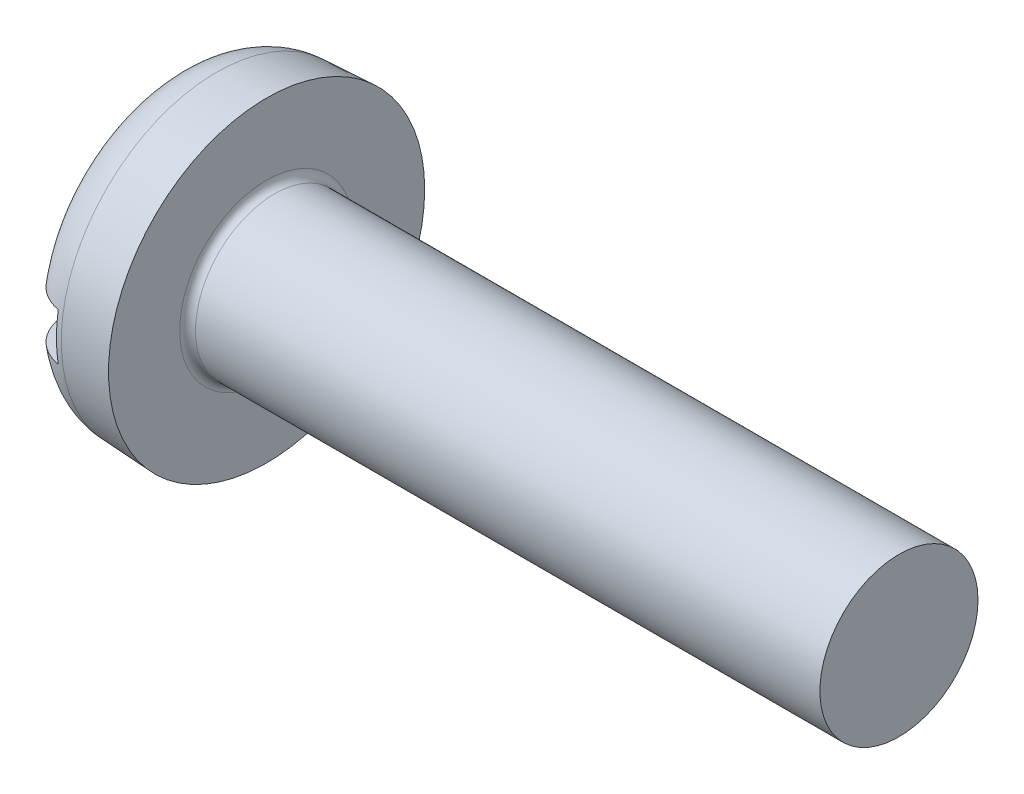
from build123d import *

# Parameters (mm, degrees)
SKETCH1_R        = 4
BASEHEAD_DEPTH   = 2.4
BASEHEAD_DRAFT   = -3
SKETCH2_R        = 2
BASEBODY_DEPTH   = 16
HEADFILLET2_R    = 1.2
NOTCH_DEPTH      = 19.50743094
NOTCH_DEPTH_BACK = 19.50743094
SKETCH3_W        = 1.2
SKETCH3_H        = 1
HEADFILLET1_R    = 0.2


with BuildPart() as part:
    # Sketch1 → BaseHead (with draft: the straight prism first)
    with BuildSketch(Plane(origin=(2.4, 0, 0), x_dir=(0, 0, -1), z_dir=(1, 0, 0))):
        Circle(SKETCH1_R)
    extrude(amount=-BASEHEAD_DEPTH)
    # BaseHead: the draft: its side faces are tilted about the plane it starts from
    basehead_sides = [part.faces().sort_by_distance(p)[0] for p in [
        (1.2, 0, 4),
    ]]
    draft(basehead_sides, Plane(origin=(2.4, 0, 0), x_dir=(0, 0, -1), z_dir=(1, 0, 0)), BASEHEAD_DRAFT)

    # Sketch2 → BaseBody (add)
    with BuildSketch(Plane(origin=(2.4, 0, 0), x_dir=(0, 0, -1), z_dir=(1, 0, 0))):
        Circle(SKETCH2_R)
    extrude(amount=BASEBODY_DEPTH)

    # HeadFillet2
    headfillet2_edges = [part.edges().sort_by_distance(p)[0] for p in [
        (0, 0, 3.87422133),
    ]]
    fillet(headfillet2_edges, radius=HEADFILLET2_R)

    # Sketch3 → Notch (cut, two sides: drawn at the far end of the back side and taken through both)
    with BuildSketch(Plane(origin=(1.05, -1.05, 0), x_dir=(0, -1, 0), z_dir=(0, 0, 1)).offset(-NOTCH_DEPTH_BACK)):
        with Locations((-1.05, -0.55)):
            Rectangle(SKETCH3_W, SKETCH3_H)
    extrude(amount=NOTCH_DEPTH + NOTCH_DEPTH_BACK, mode=Mode.SUBTRACT)

    # HeadFillet1
    headfillet1_edges = [part.edges().sort_by_distance(p)[0] for p in [
        (2.4, 0, 2),
    ]]
    fillet(headfillet1_edges, radius=HEADFILLET1_R)


solid = part.part
